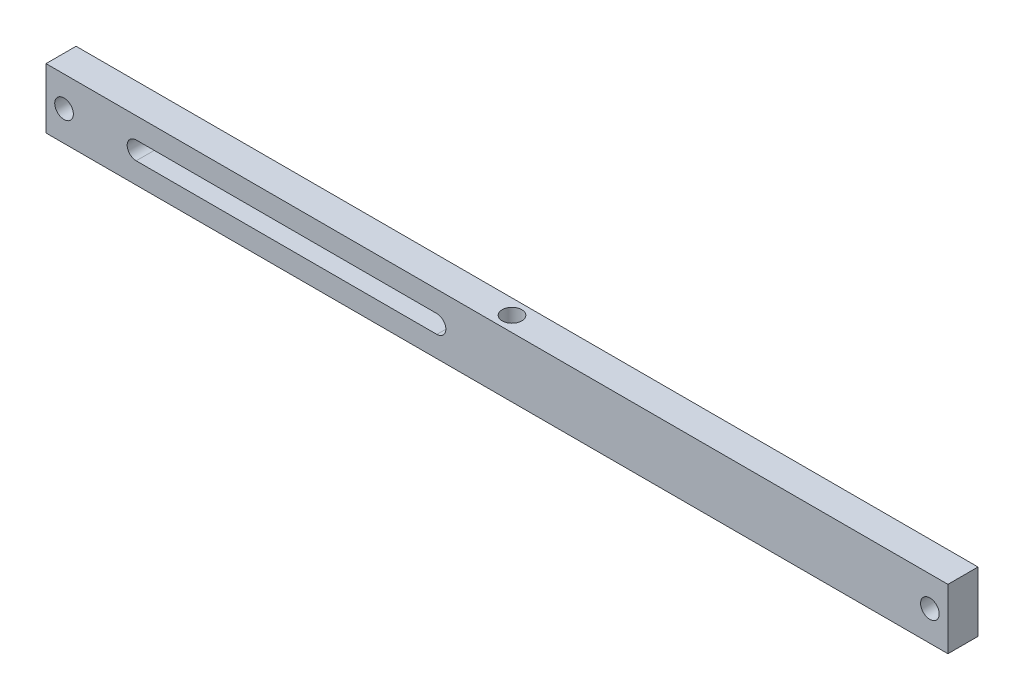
from build123d import *

# Parameters (mm, degrees)
ESQUISSE1_W             = 300
ESQUISSE1_H             = 20
ESQUISSE1_R             = 3.1
EXTRUSION1_DEPTH        = 5
ENL_V_MAT_EXTRU_1_REACH = 302.707
ESQUISSE2_R             = 3.25
ENL_V_MAT_EXTRU_2_REACH = 302.832


with BuildPart() as part:
    # Esquisse1 → Extrusion1 (new, symmetric)
    with BuildSketch(Plane.XY):
        with Locations((150, 10)):
            Rectangle(ESQUISSE1_W, ESQUISSE1_H)
        with Locations((6, 10)):
            Circle(ESQUISSE1_R, mode=Mode.SUBTRACT)
        with Locations(Location((294, 10, 0), (0, 0, 180))):
            Circle(ESQUISSE1_R, mode=Mode.SUBTRACT)
    extrude(amount=EXTRUSION1_DEPTH, both=True)

    # Esquisse2 → Enl_v. mat.-Extru.1 (cut, up to next)
    with BuildSketch(Plane(origin=(0, 20, 0), x_dir=(-1, 0, 0), z_dir=(0, 1, 0)), mode=Mode.PRIVATE) as enl_v_mat_extru_1_sk1:
        with Locations(Location((-150, 0, 0), (0, 0, 90))):
            Circle(ESQUISSE2_R)
    enl_v_mat_extru_1_tool1 = extrude(enl_v_mat_extru_1_sk1.sketch, amount=-ENL_V_MAT_EXTRU_1_REACH, mode=Mode.PRIVATE) & part.part
    add(enl_v_mat_extru_1_tool1.solids().sort_by_distance((150, 20, 0))[0], mode=Mode.SUBTRACT)

    # Esquisse3 → Enl_v. mat.-Extru.2 (cut, up to next)
    with BuildSketch(Plane.XY.offset(5), mode=Mode.PRIVATE) as enl_v_mat_extru_2_sk1:
        with BuildLine():
            Line((30, 7), (130, 7))
            ThreePointArc((130, 7), (133, 10), (130, 13))
            Line((130, 13), (30, 13))
            ThreePointArc((30, 13), (27, 10), (30, 7))
        make_face()
    enl_v_mat_extru_2_tool1 = extrude(enl_v_mat_extru_2_sk1.sketch, amount=-ENL_V_MAT_EXTRU_2_REACH, mode=Mode.PRIVATE) & part.part
    add(enl_v_mat_extru_2_tool1.solids().sort_by_distance((80, 10, 5))[0], mode=Mode.SUBTRACT)


solid = part.part
